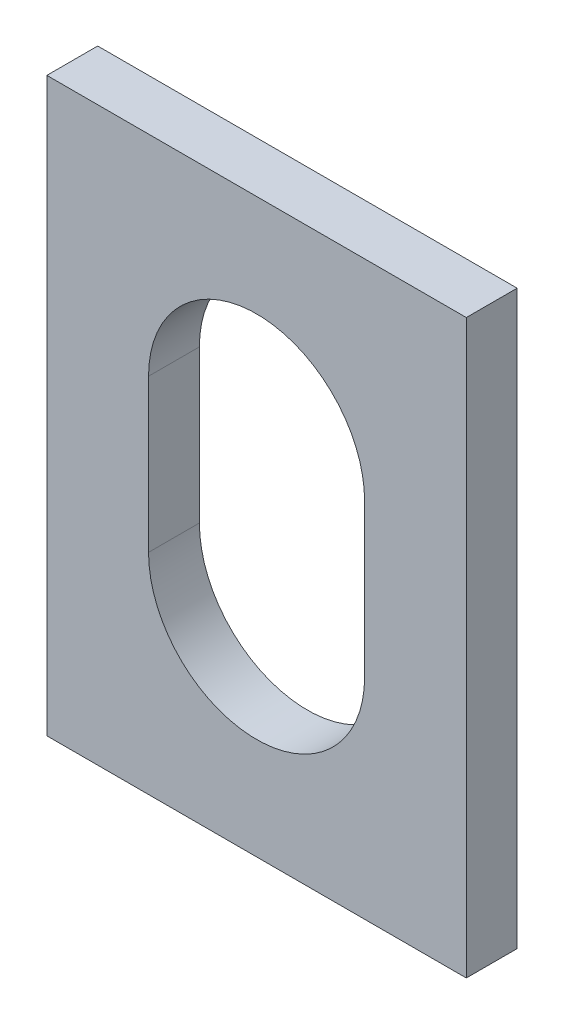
ISO-10303-21;
HEADER;
FILE_DESCRIPTION(('STEP AP214'),'2;1');
FILE_NAME('part.step','',(''),(''),'','','');
FILE_SCHEMA(('AUTOMOTIVE_DESIGN { 1 0 10303 214 1 1 1 1 }'));
ENDSEC;
DATA;
#1=APPLICATION_CONTEXT('core data for automotive mechanical design processes');
#2=APPLICATION_PROTOCOL_DEFINITION('international standard','automotive_design',2000,#1);
#3=PRODUCT_CONTEXT('',#1,'mechanical');
#4=PRODUCT('Part','Part','',(#3));
#5=PRODUCT_RELATED_PRODUCT_CATEGORY('part','',(#4));
#6=PRODUCT_DEFINITION_FORMATION('','',#4);
#7=PRODUCT_DEFINITION_CONTEXT('part definition',#1,'design');
#8=PRODUCT_DEFINITION('design','',#6,#7);
#9=PRODUCT_DEFINITION_SHAPE('','',#8);
#10=(LENGTH_UNIT() NAMED_UNIT(*) SI_UNIT(.MILLI.,.METRE.));
#11=(NAMED_UNIT(*) PLANE_ANGLE_UNIT() SI_UNIT($,.RADIAN.));
#12=(NAMED_UNIT(*) SI_UNIT($,.STERADIAN.) SOLID_ANGLE_UNIT());
#13=UNCERTAINTY_MEASURE_WITH_UNIT(LENGTH_MEASURE(1.E-05),#10,'distance_accuracy_value','');
#14=(GEOMETRIC_REPRESENTATION_CONTEXT(3) GLOBAL_UNCERTAINTY_ASSIGNED_CONTEXT((#13)) GLOBAL_UNIT_ASSIGNED_CONTEXT((#10,
#11,#12)) REPRESENTATION_CONTEXT('',''));
#15=CARTESIAN_POINT('',(0.,0.,0.));
#16=DIRECTION('',(0.,0.,1.));
#17=DIRECTION('',(1.,0.,0.));
#18=AXIS2_PLACEMENT_3D('',#15,#16,#17);
#19=CARTESIAN_POINT('',(0.,0.,4.));
#20=DIRECTION('',(0.,0.,1.));
#21=DIRECTION('',(1.,0.,0.));
#22=AXIS2_PLACEMENT_3D('',#19,#20,#21);
#23=PLANE('',#22);
#24=DIRECTION('',(0.,-1.,0.));
#25=VECTOR('',#24,1.);
#26=CARTESIAN_POINT('',(-16.5,28.5,4.));
#27=LINE('',#26,#25);
#28=CARTESIAN_POINT('',(-16.5,28.5,4.));
#29=VERTEX_POINT('',#28);
#30=CARTESIAN_POINT('',(-16.5,-16.5,4.));
#31=VERTEX_POINT('',#30);
#32=EDGE_CURVE('E134',#29,#31,#27,.T.);
#33=ORIENTED_EDGE('',*,*,#32,.T.);
#34=DIRECTION('',(1.,0.,0.));
#35=VECTOR('',#34,1.);
#36=CARTESIAN_POINT('',(-16.5,-16.5,4.));
#37=LINE('',#36,#35);
#38=CARTESIAN_POINT('',(16.5,-16.5,4.));
#39=VERTEX_POINT('',#38);
#40=EDGE_CURVE('E137',#31,#39,#37,.T.);
#41=ORIENTED_EDGE('',*,*,#40,.T.);
#42=DIRECTION('',(0.,1.,0.));
#43=VECTOR('',#42,1.);
#44=CARTESIAN_POINT('',(16.5,28.5,4.));
#45=LINE('',#44,#43);
#46=CARTESIAN_POINT('',(16.5,28.5,4.));
#47=VERTEX_POINT('',#46);
#48=EDGE_CURVE('E140',#39,#47,#45,.T.);
#49=ORIENTED_EDGE('',*,*,#48,.T.);
#50=DIRECTION('',(-1.,0.,0.));
#51=VECTOR('',#50,1.);
#52=CARTESIAN_POINT('',(-16.5,28.5,4.));
#53=LINE('',#52,#51);
#54=EDGE_CURVE('E142',#47,#29,#53,.T.);
#55=ORIENTED_EDGE('',*,*,#54,.T.);
#56=EDGE_LOOP('',(#33,#41,#49,#55));
#57=FACE_BOUND('',#56,.T.);
#58=DIRECTION('',(0.,1.,0.));
#59=VECTOR('',#58,1.);
#60=CARTESIAN_POINT('',(8.5,0.,4.));
#61=LINE('',#60,#59);
#62=CARTESIAN_POINT('',(8.5,0.,4.));
#63=VERTEX_POINT('',#62);
#64=CARTESIAN_POINT('',(8.5,12.,4.));
#65=VERTEX_POINT('',#64);
#66=EDGE_CURVE('E106',#63,#65,#61,.T.);
#67=ORIENTED_EDGE('',*,*,#66,.F.);
#68=CARTESIAN_POINT('',(0.,0.,4.));
#69=DIRECTION('',(0.,0.,1.));
#70=DIRECTION('',(1.,0.,0.));
#71=AXIS2_PLACEMENT_3D('',#68,#69,#70);
#72=CIRCLE('',#71,8.5);
#73=CARTESIAN_POINT('',(-8.5,0.,4.));
#74=VERTEX_POINT('',#73);
#75=EDGE_CURVE('E98',#74,#63,#72,.T.);
#76=ORIENTED_EDGE('',*,*,#75,.F.);
#77=DIRECTION('',(0.,-1.,0.));
#78=VECTOR('',#77,1.);
#79=CARTESIAN_POINT('',(-8.5,0.,4.));
#80=LINE('',#79,#78);
#81=CARTESIAN_POINT('',(-8.5,12.,4.));
#82=VERTEX_POINT('',#81);
#83=EDGE_CURVE('E120',#82,#74,#80,.T.);
#84=ORIENTED_EDGE('',*,*,#83,.F.);
#85=CARTESIAN_POINT('',(0.,12.,4.));
#86=DIRECTION('',(0.,0.,1.));
#87=DIRECTION('',(-1.,0.,0.));
#88=AXIS2_PLACEMENT_3D('',#85,#86,#87);
#89=CIRCLE('',#88,8.5);
#90=EDGE_CURVE('E118',#65,#82,#89,.T.);
#91=ORIENTED_EDGE('',*,*,#90,.F.);
#92=EDGE_LOOP('',(#67,#76,#84,#91));
#93=FACE_BOUND('',#92,.T.);
#94=ADVANCED_FACE('F33',(#57,#93),#23,.T.);
#95=CARTESIAN_POINT('',(0.,0.,0.));
#96=DIRECTION('',(0.,0.,1.));
#97=DIRECTION('',(1.,0.,0.));
#98=AXIS2_PLACEMENT_3D('',#95,#96,#97);
#99=PLANE('',#98);
#100=DIRECTION('',(0.,-1.,0.));
#101=VECTOR('',#100,1.);
#102=CARTESIAN_POINT('',(-16.5,28.5,0.));
#103=LINE('',#102,#101);
#104=CARTESIAN_POINT('',(-16.5,28.5,0.));
#105=VERTEX_POINT('',#104);
#106=CARTESIAN_POINT('',(-16.5,-16.5,0.));
#107=VERTEX_POINT('',#106);
#108=EDGE_CURVE('E114',#105,#107,#103,.T.);
#109=ORIENTED_EDGE('',*,*,#108,.F.);
#110=DIRECTION('',(-1.,0.,0.));
#111=VECTOR('',#110,1.);
#112=CARTESIAN_POINT('',(-16.5,28.5,0.));
#113=LINE('',#112,#111);
#114=CARTESIAN_POINT('',(16.5,28.5,0.));
#115=VERTEX_POINT('',#114);
#116=EDGE_CURVE('E138',#115,#105,#113,.T.);
#117=ORIENTED_EDGE('',*,*,#116,.F.);
#118=DIRECTION('',(0.,1.,0.));
#119=VECTOR('',#118,1.);
#120=CARTESIAN_POINT('',(16.5,28.5,0.));
#121=LINE('',#120,#119);
#122=CARTESIAN_POINT('',(16.5,-16.5,0.));
#123=VERTEX_POINT('',#122);
#124=EDGE_CURVE('E149',#123,#115,#121,.T.);
#125=ORIENTED_EDGE('',*,*,#124,.F.);
#126=DIRECTION('',(1.,0.,0.));
#127=VECTOR('',#126,1.);
#128=CARTESIAN_POINT('',(-16.5,-16.5,0.));
#129=LINE('',#128,#127);
#130=EDGE_CURVE('E147',#107,#123,#129,.T.);
#131=ORIENTED_EDGE('',*,*,#130,.F.);
#132=EDGE_LOOP('',(#109,#117,#125,#131));
#133=FACE_BOUND('',#132,.T.);
#134=CARTESIAN_POINT('',(0.,0.,0.));
#135=DIRECTION('',(0.,0.,1.));
#136=DIRECTION('',(1.,0.,0.));
#137=AXIS2_PLACEMENT_3D('',#134,#135,#136);
#138=CIRCLE('',#137,8.5);
#139=CARTESIAN_POINT('',(-8.5,0.,0.));
#140=VERTEX_POINT('',#139);
#141=CARTESIAN_POINT('',(8.5,0.,0.));
#142=VERTEX_POINT('',#141);
#143=EDGE_CURVE('E56',#140,#142,#138,.T.);
#144=ORIENTED_EDGE('',*,*,#143,.T.);
#145=DIRECTION('',(0.,1.,0.));
#146=VECTOR('',#145,1.);
#147=CARTESIAN_POINT('',(8.5,0.,0.));
#148=LINE('',#147,#146);
#149=CARTESIAN_POINT('',(8.5,12.,0.));
#150=VERTEX_POINT('',#149);
#151=EDGE_CURVE('E113',#142,#150,#148,.T.);
#152=ORIENTED_EDGE('',*,*,#151,.T.);
#153=CARTESIAN_POINT('',(0.,12.,0.));
#154=DIRECTION('',(0.,0.,1.));
#155=DIRECTION('',(-1.,0.,0.));
#156=AXIS2_PLACEMENT_3D('',#153,#154,#155);
#157=CIRCLE('',#156,8.5);
#158=CARTESIAN_POINT('',(-8.5,12.,0.));
#159=VERTEX_POINT('',#158);
#160=EDGE_CURVE('E126',#150,#159,#157,.T.);
#161=ORIENTED_EDGE('',*,*,#160,.T.);
#162=DIRECTION('',(0.,-1.,0.));
#163=VECTOR('',#162,1.);
#164=CARTESIAN_POINT('',(-8.5,0.,0.));
#165=LINE('',#164,#163);
#166=EDGE_CURVE('E107',#159,#140,#165,.T.);
#167=ORIENTED_EDGE('',*,*,#166,.T.);
#168=EDGE_LOOP('',(#144,#152,#161,#167));
#169=FACE_BOUND('',#168,.T.);
#170=ADVANCED_FACE('F167',(#133,#169),#99,.F.);
#171=CARTESIAN_POINT('',(-16.5,28.5,4.));
#172=DIRECTION('',(1.,0.,0.));
#173=DIRECTION('',(0.,1.,0.));
#174=AXIS2_PLACEMENT_3D('',#171,#172,#173);
#175=PLANE('',#174);
#176=ORIENTED_EDGE('',*,*,#108,.T.);
#177=DIRECTION('',(0.,0.,-1.));
#178=VECTOR('',#177,1.);
#179=CARTESIAN_POINT('',(-16.5,-16.5,4.));
#180=LINE('',#179,#178);
#181=EDGE_CURVE('E11',#31,#107,#180,.T.);
#182=ORIENTED_EDGE('',*,*,#181,.F.);
#183=ORIENTED_EDGE('',*,*,#32,.F.);
#184=DIRECTION('',(0.,0.,-1.));
#185=VECTOR('',#184,1.);
#186=CARTESIAN_POINT('',(-16.5,28.5,4.));
#187=LINE('',#186,#185);
#188=EDGE_CURVE('E144',#29,#105,#187,.T.);
#189=ORIENTED_EDGE('',*,*,#188,.T.);
#190=EDGE_LOOP('',(#176,#182,#183,#189));
#191=FACE_BOUND('',#190,.T.);
#192=ADVANCED_FACE('F35',(#191),#175,.F.);
#193=CARTESIAN_POINT('',(-16.5,-16.5,4.));
#194=DIRECTION('',(0.,1.,0.));
#195=DIRECTION('',(0.,0.,1.));
#196=AXIS2_PLACEMENT_3D('',#193,#194,#195);
#197=PLANE('',#196);
#198=ORIENTED_EDGE('',*,*,#130,.T.);
#199=DIRECTION('',(0.,0.,-1.));
#200=VECTOR('',#199,1.);
#201=CARTESIAN_POINT('',(16.5,-16.5,4.));
#202=LINE('',#201,#200);
#203=EDGE_CURVE('E41',#39,#123,#202,.T.);
#204=ORIENTED_EDGE('',*,*,#203,.F.);
#205=ORIENTED_EDGE('',*,*,#40,.F.);
#206=ORIENTED_EDGE('',*,*,#181,.T.);
#207=EDGE_LOOP('',(#198,#204,#205,#206));
#208=FACE_BOUND('',#207,.T.);
#209=ADVANCED_FACE('F177',(#208),#197,.F.);
#210=CARTESIAN_POINT('',(16.5,28.5,4.));
#211=DIRECTION('',(-1.,0.,0.));
#212=DIRECTION('',(0.,-1.,0.));
#213=AXIS2_PLACEMENT_3D('',#210,#211,#212);
#214=PLANE('',#213);
#215=ORIENTED_EDGE('',*,*,#124,.T.);
#216=DIRECTION('',(0.,0.,-1.));
#217=VECTOR('',#216,1.);
#218=CARTESIAN_POINT('',(16.5,28.5,4.));
#219=LINE('',#218,#217);
#220=EDGE_CURVE('E154',#47,#115,#219,.T.);
#221=ORIENTED_EDGE('',*,*,#220,.F.);
#222=ORIENTED_EDGE('',*,*,#48,.F.);
#223=ORIENTED_EDGE('',*,*,#203,.T.);
#224=EDGE_LOOP('',(#215,#221,#222,#223));
#225=FACE_BOUND('',#224,.T.);
#226=ADVANCED_FACE('F161',(#225),#214,.F.);
#227=CARTESIAN_POINT('',(-16.5,28.5,4.));
#228=DIRECTION('',(0.,-1.,0.));
#229=DIRECTION('',(0.,0.,-1.));
#230=AXIS2_PLACEMENT_3D('',#227,#228,#229);
#231=PLANE('',#230);
#232=ORIENTED_EDGE('',*,*,#116,.T.);
#233=ORIENTED_EDGE('',*,*,#188,.F.);
#234=ORIENTED_EDGE('',*,*,#54,.F.);
#235=ORIENTED_EDGE('',*,*,#220,.T.);
#236=EDGE_LOOP('',(#232,#233,#234,#235));
#237=FACE_BOUND('',#236,.T.);
#238=ADVANCED_FACE('F171',(#237),#231,.F.);
#239=CARTESIAN_POINT('',(0.,0.,4.));
#240=DIRECTION('',(0.,0.,-1.));
#241=DIRECTION('',(-1.,0.,0.));
#242=AXIS2_PLACEMENT_3D('',#239,#240,#241);
#243=CYLINDRICAL_SURFACE('',#242,8.5);
#244=ORIENTED_EDGE('',*,*,#143,.F.);
#245=DIRECTION('',(0.,0.,-1.));
#246=VECTOR('',#245,1.);
#247=CARTESIAN_POINT('',(-8.5,0.,4.));
#248=LINE('',#247,#246);
#249=EDGE_CURVE('E102',#74,#140,#248,.T.);
#250=ORIENTED_EDGE('',*,*,#249,.F.);
#251=ORIENTED_EDGE('',*,*,#75,.T.);
#252=DIRECTION('',(0.,0.,-1.));
#253=VECTOR('',#252,1.);
#254=CARTESIAN_POINT('',(8.5,0.,4.));
#255=LINE('',#254,#253);
#256=EDGE_CURVE('E101',#63,#142,#255,.T.);
#257=ORIENTED_EDGE('',*,*,#256,.T.);
#258=EDGE_LOOP('',(#244,#250,#251,#257));
#259=FACE_BOUND('',#258,.T.);
#260=ADVANCED_FACE('F100',(#259),#243,.F.);
#261=CARTESIAN_POINT('',(8.5,0.,4.));
#262=DIRECTION('',(-1.,0.,0.));
#263=DIRECTION('',(0.,-1.,0.));
#264=AXIS2_PLACEMENT_3D('',#261,#262,#263);
#265=PLANE('',#264);
#266=ORIENTED_EDGE('',*,*,#151,.F.);
#267=ORIENTED_EDGE('',*,*,#256,.F.);
#268=ORIENTED_EDGE('',*,*,#66,.T.);
#269=DIRECTION('',(0.,0.,-1.));
#270=VECTOR('',#269,1.);
#271=CARTESIAN_POINT('',(8.5,12.,4.));
#272=LINE('',#271,#270);
#273=EDGE_CURVE('E115',#65,#150,#272,.T.);
#274=ORIENTED_EDGE('',*,*,#273,.T.);
#275=EDGE_LOOP('',(#266,#267,#268,#274));
#276=FACE_BOUND('',#275,.T.);
#277=ADVANCED_FACE('F110',(#276),#265,.T.);
#278=CARTESIAN_POINT('',(0.,12.,4.));
#279=DIRECTION('',(0.,0.,-1.));
#280=DIRECTION('',(-1.,0.,0.));
#281=AXIS2_PLACEMENT_3D('',#278,#279,#280);
#282=CYLINDRICAL_SURFACE('',#281,8.5);
#283=ORIENTED_EDGE('',*,*,#160,.F.);
#284=ORIENTED_EDGE('',*,*,#273,.F.);
#285=ORIENTED_EDGE('',*,*,#90,.T.);
#286=DIRECTION('',(0.,0.,-1.));
#287=VECTOR('',#286,1.);
#288=CARTESIAN_POINT('',(-8.5,12.,4.));
#289=LINE('',#288,#287);
#290=EDGE_CURVE('E48',#82,#159,#289,.T.);
#291=ORIENTED_EDGE('',*,*,#290,.T.);
#292=EDGE_LOOP('',(#283,#284,#285,#291));
#293=FACE_BOUND('',#292,.T.);
#294=ADVANCED_FACE('F200',(#293),#282,.F.);
#295=CARTESIAN_POINT('',(-8.5,0.,4.));
#296=DIRECTION('',(1.,0.,0.));
#297=DIRECTION('',(0.,1.,0.));
#298=AXIS2_PLACEMENT_3D('',#295,#296,#297);
#299=PLANE('',#298);
#300=ORIENTED_EDGE('',*,*,#166,.F.);
#301=ORIENTED_EDGE('',*,*,#290,.F.);
#302=ORIENTED_EDGE('',*,*,#83,.T.);
#303=ORIENTED_EDGE('',*,*,#249,.T.);
#304=EDGE_LOOP('',(#300,#301,#302,#303));
#305=FACE_BOUND('',#304,.T.);
#306=ADVANCED_FACE('F204',(#305),#299,.T.);
#307=CLOSED_SHELL('',(#94,#170,#192,#209,#226,#238,#260,#277,#294,#306));
#308=MANIFOLD_SOLID_BREP('B2',#307);
#309=ADVANCED_BREP_SHAPE_REPRESENTATION('',(#18,#308),#14);
#310=SHAPE_DEFINITION_REPRESENTATION(#9,#309);
ENDSEC;
END-ISO-10303-21;
